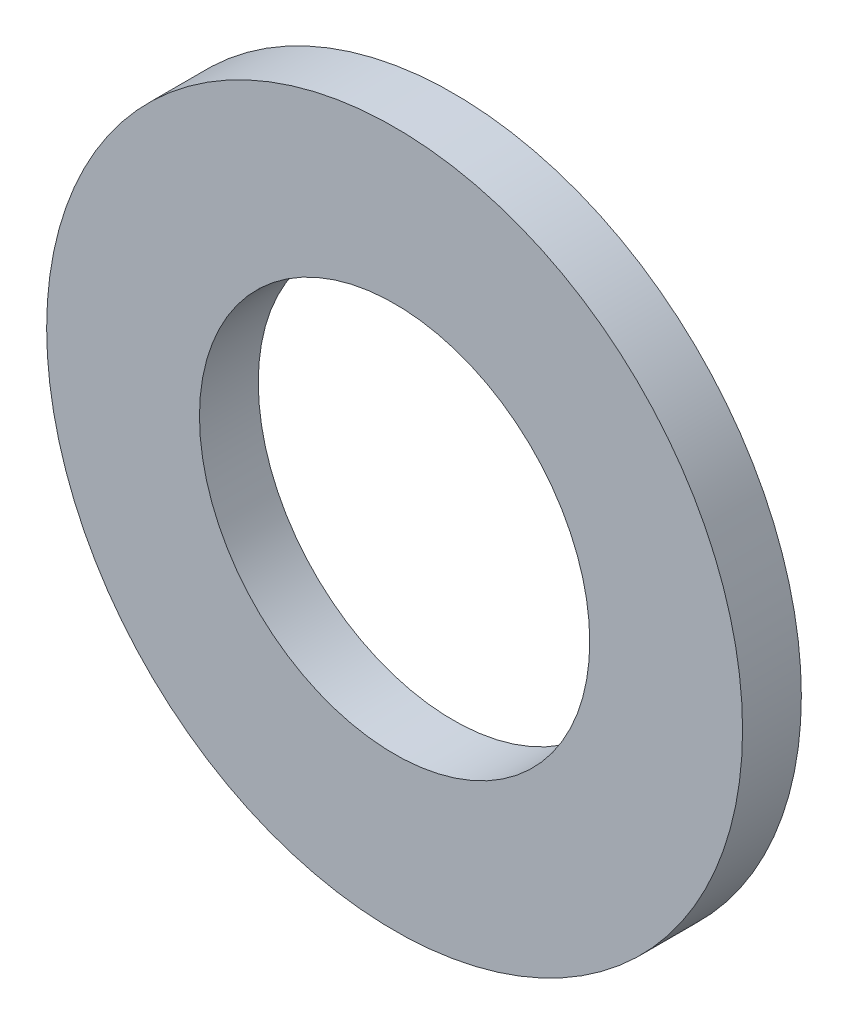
ISO-10303-21;
HEADER;
FILE_DESCRIPTION(('STEP AP214'),'2;1');
FILE_NAME('part.step','',(''),(''),'','','');
FILE_SCHEMA(('AUTOMOTIVE_DESIGN { 1 0 10303 214 1 1 1 1 }'));
ENDSEC;
DATA;
#1=APPLICATION_CONTEXT('core data for automotive mechanical design processes');
#2=APPLICATION_PROTOCOL_DEFINITION('international standard','automotive_design',2000,#1);
#3=PRODUCT_CONTEXT('',#1,'mechanical');
#4=PRODUCT('Part','Part','',(#3));
#5=PRODUCT_RELATED_PRODUCT_CATEGORY('part','',(#4));
#6=PRODUCT_DEFINITION_FORMATION('','',#4);
#7=PRODUCT_DEFINITION_CONTEXT('part definition',#1,'design');
#8=PRODUCT_DEFINITION('design','',#6,#7);
#9=PRODUCT_DEFINITION_SHAPE('','',#8);
#10=(LENGTH_UNIT() NAMED_UNIT(*) SI_UNIT(.MILLI.,.METRE.));
#11=(NAMED_UNIT(*) PLANE_ANGLE_UNIT() SI_UNIT($,.RADIAN.));
#12=(NAMED_UNIT(*) SI_UNIT($,.STERADIAN.) SOLID_ANGLE_UNIT());
#13=UNCERTAINTY_MEASURE_WITH_UNIT(LENGTH_MEASURE(1.E-05),#10,'distance_accuracy_value','');
#14=(GEOMETRIC_REPRESENTATION_CONTEXT(3) GLOBAL_UNCERTAINTY_ASSIGNED_CONTEXT((#13)) GLOBAL_UNIT_ASSIGNED_CONTEXT((#10,
#11,#12)) REPRESENTATION_CONTEXT('',''));
#15=CARTESIAN_POINT('',(0.,0.,0.));
#16=DIRECTION('',(0.,0.,1.));
#17=DIRECTION('',(1.,0.,0.));
#18=AXIS2_PLACEMENT_3D('',#15,#16,#17);
#19=CARTESIAN_POINT('',(0.,0.,3.175));
#20=DIRECTION('',(0.,0.,-1.));
#21=DIRECTION('',(-1.,0.,0.));
#22=AXIS2_PLACEMENT_3D('',#19,#20,#21);
#23=CYLINDRICAL_SURFACE('',#22,18.796);
#24=CARTESIAN_POINT('',(0.,0.,3.175));
#25=DIRECTION('',(0.,0.,1.));
#26=DIRECTION('',(1.,0.,0.));
#27=AXIS2_PLACEMENT_3D('',#24,#25,#26);
#28=CIRCLE('',#27,18.796);
#29=CARTESIAN_POINT('',(18.796,0.,3.175));
#30=VERTEX_POINT('',#29);
#31=EDGE_CURVE('E10',#30,#30,#28,.T.);
#32=ORIENTED_EDGE('',*,*,#31,.F.);
#33=EDGE_LOOP('',(#32));
#34=FACE_BOUND('',#33,.T.);
#35=CARTESIAN_POINT('',(0.,0.,0.));
#36=DIRECTION('',(0.,0.,1.));
#37=DIRECTION('',(1.,0.,0.));
#38=AXIS2_PLACEMENT_3D('',#35,#36,#37);
#39=CIRCLE('',#38,18.796);
#40=CARTESIAN_POINT('',(18.796,0.,0.));
#41=VERTEX_POINT('',#40);
#42=EDGE_CURVE('E35',#41,#41,#39,.T.);
#43=ORIENTED_EDGE('',*,*,#42,.T.);
#44=EDGE_LOOP('',(#43));
#45=FACE_BOUND('',#44,.T.);
#46=ADVANCED_FACE('F29',(#34,#45),#23,.T.);
#47=CARTESIAN_POINT('',(0.,0.,3.175));
#48=DIRECTION('',(0.,0.,1.));
#49=DIRECTION('',(1.,0.,0.));
#50=AXIS2_PLACEMENT_3D('',#47,#48,#49);
#51=PLANE('',#50);
#52=CARTESIAN_POINT('',(0.,0.,3.175));
#53=DIRECTION('',(0.,0.,1.));
#54=DIRECTION('',(1.,0.,0.));
#55=AXIS2_PLACEMENT_3D('',#52,#53,#54);
#56=CIRCLE('',#55,10.541);
#57=CARTESIAN_POINT('',(10.541,0.,3.175));
#58=VERTEX_POINT('',#57);
#59=EDGE_CURVE('E43',#58,#58,#56,.T.);
#60=ORIENTED_EDGE('',*,*,#59,.F.);
#61=EDGE_LOOP('',(#60));
#62=FACE_BOUND('',#61,.T.);
#63=ORIENTED_EDGE('',*,*,#31,.T.);
#64=EDGE_LOOP('',(#63));
#65=FACE_BOUND('',#64,.T.);
#66=ADVANCED_FACE('F51',(#62,#65),#51,.T.);
#67=CARTESIAN_POINT('',(0.,0.,0.));
#68=DIRECTION('',(0.,0.,1.));
#69=DIRECTION('',(1.,0.,0.));
#70=AXIS2_PLACEMENT_3D('',#67,#68,#69);
#71=PLANE('',#70);
#72=CARTESIAN_POINT('',(0.,0.,0.));
#73=DIRECTION('',(0.,0.,1.));
#74=DIRECTION('',(1.,0.,0.));
#75=AXIS2_PLACEMENT_3D('',#72,#73,#74);
#76=CIRCLE('',#75,10.541);
#77=CARTESIAN_POINT('',(10.541,0.,0.));
#78=VERTEX_POINT('',#77);
#79=EDGE_CURVE('E39',#78,#78,#76,.T.);
#80=ORIENTED_EDGE('',*,*,#79,.T.);
#81=EDGE_LOOP('',(#80));
#82=FACE_BOUND('',#81,.T.);
#83=ORIENTED_EDGE('',*,*,#42,.F.);
#84=EDGE_LOOP('',(#83));
#85=FACE_BOUND('',#84,.T.);
#86=ADVANCED_FACE('F53',(#82,#85),#71,.F.);
#87=CARTESIAN_POINT('',(0.,0.,0.));
#88=DIRECTION('',(0.,0.,1.));
#89=DIRECTION('',(1.,0.,0.));
#90=AXIS2_PLACEMENT_3D('',#87,#88,#89);
#91=CYLINDRICAL_SURFACE('',#90,10.541);
#92=ORIENTED_EDGE('',*,*,#79,.F.);
#93=EDGE_LOOP('',(#92));
#94=FACE_BOUND('',#93,.T.);
#95=ORIENTED_EDGE('',*,*,#59,.T.);
#96=EDGE_LOOP('',(#95));
#97=FACE_BOUND('',#96,.T.);
#98=ADVANCED_FACE('F49',(#94,#97),#91,.F.);
#99=CLOSED_SHELL('',(#46,#66,#86,#98));
#100=MANIFOLD_SOLID_BREP('B2',#99);
#101=ADVANCED_BREP_SHAPE_REPRESENTATION('',(#18,#100),#14);
#102=SHAPE_DEFINITION_REPRESENTATION(#9,#101);
ENDSEC;
END-ISO-10303-21;
